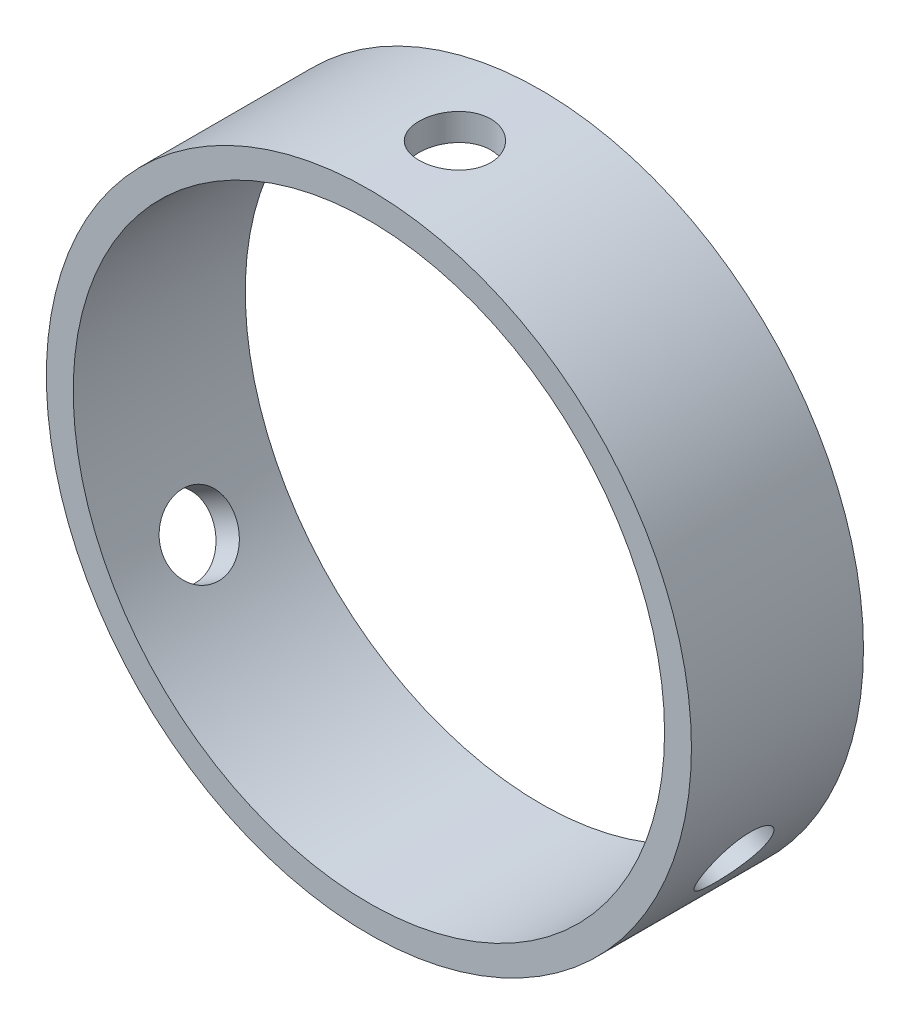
from build123d import *

# Parameters (mm, degrees)
SKETCH1_R               = 57.15
SKETCH1_R_2             = 52.3875
EXTRUDE1_DEPTH          = 15.24
CUT_EXTRUDE1_REACH      = 130.697
CUT_EXTRUDE1_END_RADIUS = 52.3875
SKETCH2_R               = 6.35
CIRPATTERN1_COUNT       = 3


with BuildPart() as part:
    # Sketch1 → Extrude1 (new, symmetric)
    with BuildSketch(Plane.XY):
        with Locations(Location((0, 0, 0), (0, 0, 180))):
            Circle(SKETCH1_R)
        with Locations(Location((0, 0, 0), (0, 0, 180))):
            Circle(SKETCH1_R_2, mode=Mode.SUBTRACT)
    extrude(amount=EXTRUDE1_DEPTH, both=True)

    # Cut-Extrude1: up to this cylinder (the profile starts outside it)
    cut_extrude1_end = Plane(origin=(0, 0, 0), z_dir=(0, 0, -1)) * Cylinder(CUT_EXTRUDE1_END_RADIUS, 367.169, mode=Mode.PRIVATE)
    # Sketch2 → Cut-Extrude1 (cut, up to the surface)
    with BuildSketch(Plane(origin=(0, 57.15, 0), x_dir=(-1, 0, 0), z_dir=(0, 1, 0)), mode=Mode.PRIVATE) as cut_extrude1_sk1:
        with Locations(Location((0, 0, 0), (0, 0, 90))):
            Circle(SKETCH2_R)
    cut_extrude1_tool1 = extrude(cut_extrude1_sk1.sketch, amount=-CUT_EXTRUDE1_REACH, mode=Mode.PRIVATE) - cut_extrude1_end
    cut_extrude1 = cut_extrude1_tool1.solids().sort_by_distance((0, 57.15, 0))[0]
    add(cut_extrude1, mode=Mode.SUBTRACT)

    # CirPattern1: Cut-Extrude1 ×3 about axis
    cirpattern1_axis = Axis((0, 0, 15.24), (0, 0, -1))
    for i in range(1, CIRPATTERN1_COUNT):
        add(cut_extrude1.rotate(cirpattern1_axis, i * 360 / CIRPATTERN1_COUNT), mode=Mode.SUBTRACT)


solid = part.part
